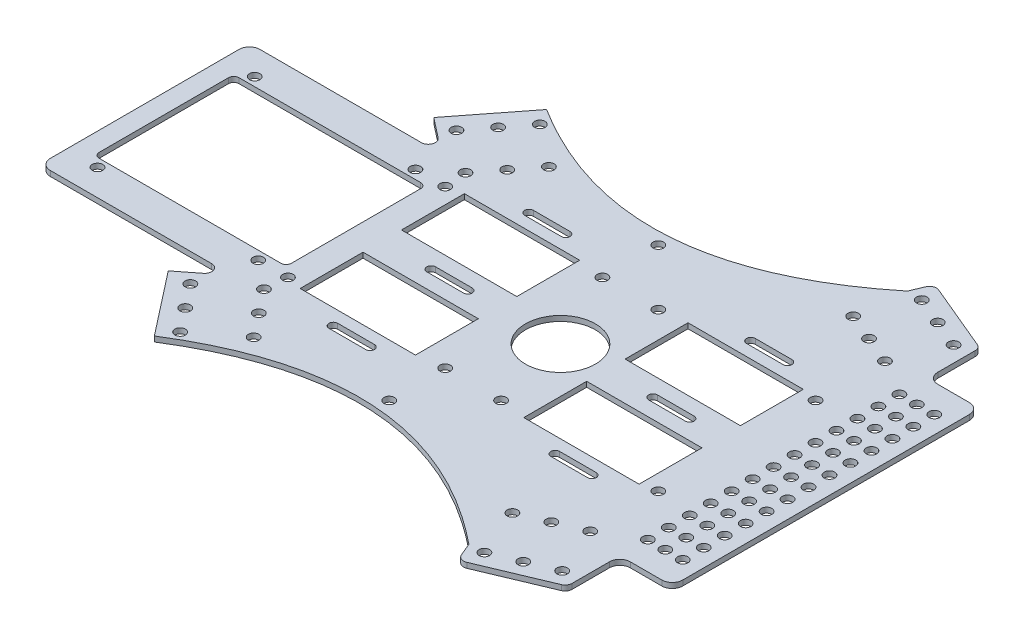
from build123d import *

# Parameters (mm, degrees)
EXTRUDE_2_DEPTH        = 1.5
CUT_EXTRUDE_1612_DEPTH = 207.41405532
SKETCH_6_R             = 10
SKETCH_6_W             = 33
SKETCH_6_H             = 18
CUT_EXTRUDE_2642_DEPTH = 207.41405532
SKETCH_7_R             = 1.5
CUT_EXTRUDE_3068_DEPTH = 207.41405532
SKETCH_8_R             = 1.5
CUT_EXTRUDE_3652_DEPTH = 207.41405532
SKETCH_9_R             = 1.5
CUT_EXTRUDE_4097_DEPTH = 207.41405532


with BuildPart() as part:
    # Sketch 1 → Extrude 2 (new body)
    with BuildSketch(Plane(origin=(0, 0, 0), x_dir=(1, 0, 0), z_dir=(0, 1, 0))):
        with BuildLine():
            Line((0, -27), (0, 27))
            ThreePointArc((0, 27), (0.878679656, 29.121320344), (3, 30))
            Line((3, 30), (49.188262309, 30))
            ThreePointArc((49.188262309, 30), (51.0794138, 31.349195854), (50.419031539, 33.576453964))
            Line((50.419031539, 33.576453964), (44.753049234, 38))
            Line((44.753049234, 38), (58.906895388, 56.129220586))
            add(Edge.make_bspline(
                [(58.906895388, 56.129220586), (108.824561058, 24.835581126), (155.548488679, 62.758137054)],
                knots=[0, 0, 0, 1, 1, 1], degree=2))
            Line((155.548488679, 62.758137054), (157.096883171, 66.446290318))
            ThreePointArc((157.096883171, 66.446290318), (158.184440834, 67.523492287), (159.715157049, 67.516169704))
            Line((159.715157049, 67.516169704), (178.774197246, 59.514627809))
            ThreePointArc((178.774197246, 59.514627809), (179.665592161, 58.777710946), (180, 57.670551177))
            Line((180, 57.670551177), (180, 47))
            ThreePointArc((180, 47), (180.878679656, 44.878679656), (183, 44))
            Line((183, 44), (192, 44))
            ThreePointArc((192, 44), (194.121320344, 43.121320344), (195, 41))
            Line((195, 41), (195, -41))
            ThreePointArc((195, -41), (194.121320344, -43.121320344), (192, -44))
            Line((192, -44), (183, -44))
            ThreePointArc((183, -44), (180.878679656, -44.878679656), (180, -47))
            Line((180, -47), (180, -57.670551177))
            ThreePointArc((180, -57.670551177), (179.665592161, -58.777710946), (178.774197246, -59.514627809))
            Line((178.774197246, -59.514627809), (159.715157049, -67.516169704))
            ThreePointArc((159.715157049, -67.516169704), (158.184440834, -67.523492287), (157.096883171, -66.446290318))
            Line((157.096883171, -66.446290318), (155.548488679, -62.758137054))
            add(Edge.make_bspline(
                [(58.906895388, -56.129220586), (108.824561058, -24.835581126), (155.548488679, -62.758137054)],
                knots=[0, 0, 0, 1, 1, 1], degree=2))
            Line((58.906895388, -56.129220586), (44.753049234, -38))
            Line((44.753049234, -38), (50.419031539, -33.576453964))
            ThreePointArc((50.419031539, -33.576453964), (51.0794138, -31.349195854), (49.188262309, -30))
            Line((49.188262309, -30), (3, -30))
            ThreePointArc((3, -30), (0.878679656, -29.121320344), (0, -27))
        make_face()
    extrude(amount=EXTRUDE_2_DEPTH)

    # Sketch 5 → Cut-Extrude 1612 (cut, through all)
    with BuildSketch(Plane(origin=(0, 1.5, 0), x_dir=(1, 0, 0), z_dir=(0, 1, 0))):
        with BuildLine():
            Line((7, 20), (59, 20))
            ThreePointArc((59, 20), (60.060660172, 19.560660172), (60.5, 18.5))
            Line((60.5, 18.5), (60.5, -18.5))
            ThreePointArc((60.5, -18.5), (60.060660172, -19.560660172), (59, -20))
            Line((59, -20), (7, -20))
            ThreePointArc((7, -20), (5.939339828, -19.560660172), (5.5, -18.5))
            Line((5.5, -18.5), (5.5, 18.5))
            ThreePointArc((5.5, 18.5), (5.939339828, 19.560660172), (7, 20))
        make_face()
    extrude(amount=-CUT_EXTRUDE_1612_DEPTH, mode=Mode.SUBTRACT)

    # Sketch 6 → Cut-Extrude 2642 (cut, through all)
    with BuildSketch(Plane(origin=(0, 1.5, 0), x_dir=(1, 0, 0), z_dir=(0, 1, 0))):
        with Locations(Location((119, 0, 0), (0, 0, 270))):
            Circle(SKETCH_6_R)
        with Locations((84.5, 14.5)):
            Rectangle(SKETCH_6_W, SKETCH_6_H)
        with Locations((148.5, 14.5)):
            Rectangle(SKETCH_6_W, SKETCH_6_H)
        with BuildLine():
            Line((145.5, 1.25), (156, 1.25))
            ThreePointArc((156, 1.25), (157.25, 0), (156, -1.25))
            Line((156, -1.25), (145.5, -1.25))
            ThreePointArc((145.5, -1.25), (144.25, 0), (145.5, 1.25))
        make_face()
        with BuildLine():
            Line((82, 1.25), (92.5, 1.25))
            ThreePointArc((92.5, 1.25), (93.75, 0), (92.5, -1.25))
            Line((92.5, -1.25), (82, -1.25))
            ThreePointArc((82, -1.25), (80.75, 0), (82, 1.25))
        make_face()
        with BuildLine():
            Line((145.5, 29.25), (156, 29.25))
            ThreePointArc((156, 29.25), (157.25, 28), (156, 26.75))
            Line((156, 26.75), (145.5, 26.75))
            ThreePointArc((145.5, 26.75), (144.25, 28), (145.5, 29.25))
        make_face()
        with BuildLine():
            Line((82, 29.25), (92.5, 29.25))
            ThreePointArc((92.5, 29.25), (93.75, 28), (92.5, 26.75))
            Line((92.5, 26.75), (82, 26.75))
            ThreePointArc((82, 26.75), (80.75, 28), (82, 29.25))
        make_face()
        with BuildLine():
            Line((145.5, -29.25), (156, -29.25))
            ThreePointArc((156, -29.25), (157.25, -28), (156, -26.75))
            Line((156, -26.75), (145.5, -26.75))
            ThreePointArc((145.5, -26.75), (144.25, -28), (145.5, -29.25))
        make_face()
        with BuildLine():
            Line((82, -29.25), (92.5, -29.25))
            ThreePointArc((92.5, -29.25), (93.75, -28), (92.5, -26.75))
            Line((92.5, -26.75), (82, -26.75))
            ThreePointArc((82, -26.75), (80.75, -28), (82, -29.25))
        make_face()
        with Locations((148.5, -14.5)):
            Rectangle(SKETCH_6_W, SKETCH_6_H)
        with Locations((84.5, -14.5)):
            Rectangle(SKETCH_6_W, SKETCH_6_H)
    extrude(amount=-CUT_EXTRUDE_2642_DEPTH, mode=Mode.SUBTRACT)

    # Sketch 7 → Cut-Extrude 3068 (cut, through all)
    with BuildSketch(Plane(origin=(0, 1.5, 0), x_dir=(1, 0, 0), z_dir=(0, 1, 0))):
        with Locations(Location((190, 36, 0), (0, 0, 270))):
            Circle(SKETCH_7_R)
        with Locations(Location((185, 36, 0), (0, 0, 270))):
            Circle(SKETCH_7_R)
        with Locations(Location((180, 36, 0), (0, 0, 270))):
            Circle(SKETCH_7_R)
        with Locations(Location((190, 30, 0), (0, 0, 270))):
            Circle(SKETCH_7_R)
        with Locations(Location((185, 30, 0), (0, 0, 270))):
            Circle(SKETCH_7_R)
        with Locations(Location((180, 30, 0), (0, 0, 270))):
            Circle(SKETCH_7_R)
        with Locations(Location((190, 24, 0), (0, 0, 270))):
            Circle(SKETCH_7_R)
        with Locations(Location((185, 24, 0), (0, 0, 270))):
            Circle(SKETCH_7_R)
        with Locations(Location((180, 24, 0), (0, 0, 270))):
            Circle(SKETCH_7_R)
        with Locations(Location((190, 18, 0), (0, 0, 270))):
            Circle(SKETCH_7_R)
        with Locations(Location((185, 18, 0), (0, 0, 270))):
            Circle(SKETCH_7_R)
        with Locations(Location((180, 18, 0), (0, 0, 270))):
            Circle(SKETCH_7_R)
        with Locations(Location((190, 12, 0), (0, 0, 270))):
            Circle(SKETCH_7_R)
        with Locations(Location((185, 12, 0), (0, 0, 270))):
            Circle(SKETCH_7_R)
        with Locations(Location((180, 12, 0), (0, 0, 270))):
            Circle(SKETCH_7_R)
        with Locations(Location((190, 6, 0), (0, 0, 270))):
            Circle(SKETCH_7_R)
        with Locations(Location((185, 6, 0), (0, 0, 270))):
            Circle(SKETCH_7_R)
        with Locations(Location((180, 6, 0), (0, 0, 270))):
            Circle(SKETCH_7_R)
        with Locations(Location((190, 0, 0), (0, 0, 270))):
            Circle(SKETCH_7_R)
        with Locations(Location((185, 0, 0), (0, 0, 270))):
            Circle(SKETCH_7_R)
        with Locations(Location((180, 0, 0), (0, 0, 270))):
            Circle(SKETCH_7_R)
        with Locations(Location((190, -6, 0), (0, 0, 270))):
            Circle(SKETCH_7_R)
        with Locations(Location((185, -6, 0), (0, 0, 270))):
            Circle(SKETCH_7_R)
        with Locations(Location((180, -6, 0), (0, 0, 270))):
            Circle(SKETCH_7_R)
        with Locations(Location((190, -12, 0), (0, 0, 270))):
            Circle(SKETCH_7_R)
        with Locations(Location((185, -12, 0), (0, 0, 270))):
            Circle(SKETCH_7_R)
        with Locations(Location((180, -12, 0), (0, 0, 270))):
            Circle(SKETCH_7_R)
        with Locations(Location((190, -18, 0), (0, 0, 270))):
            Circle(SKETCH_7_R)
        with Locations(Location((185, -18, 0), (0, 0, 270))):
            Circle(SKETCH_7_R)
        with Locations(Location((180, -18, 0), (0, 0, 270))):
            Circle(SKETCH_7_R)
        with Locations(Location((190, -24, 0), (0, 0, 270))):
            Circle(SKETCH_7_R)
        with Locations(Location((185, -24, 0), (0, 0, 270))):
            Circle(SKETCH_7_R)
        with Locations(Location((180, -24, 0), (0, 0, 270))):
            Circle(SKETCH_7_R)
        with Locations(Location((190, -30, 0), (0, 0, 270))):
            Circle(SKETCH_7_R)
        with Locations(Location((185, -30, 0), (0, 0, 270))):
            Circle(SKETCH_7_R)
        with Locations(Location((180, -30, 0), (0, 0, 270))):
            Circle(SKETCH_7_R)
        with Locations(Location((190, -36, 0), (0, 0, 270))):
            Circle(SKETCH_7_R)
        with Locations(Location((185, -36, 0), (0, 0, 270))):
            Circle(SKETCH_7_R)
        with Locations(Location((180, -36, 0), (0, 0, 270))):
            Circle(SKETCH_7_R)
    extrude(amount=-CUT_EXTRUDE_3068_DEPTH, mode=Mode.SUBTRACT)

    # Sketch 8 → Cut-Extrude 3652 (cut, through all)
    with BuildSketch(Plane(origin=(0, 1.5, 0), x_dir=(1, 0, 0), z_dir=(0, 1, 0))):
        with Locations(Location((51.155722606, 38.075984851, 0), (0, 0, 270))):
            Circle(SKETCH_8_R)
        with Locations(Location((56.386491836, 44.775914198, 0), (0, 0, 270))):
            Circle(SKETCH_8_R)
        with Locations(Location((61.617261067, 51.475843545, 0), (0, 0, 270))):
            Circle(SKETCH_8_R)
        with Locations(Location((62.979127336, 28.84521562, 0), (0, 0, 270))):
            Circle(SKETCH_8_R)
        with Locations(Location((68.209896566, 35.545144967, 0), (0, 0, 270))):
            Circle(SKETCH_8_R)
        with Locations(Location((73.440665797, 42.245074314, 0), (0, 0, 270))):
            Circle(SKETCH_8_R)
        with Locations(Location((159.817289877, 62.592800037, 0), (0, 0, 270))):
            Circle(SKETCH_8_R)
        with Locations(Location((167.654615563, 59.302461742, 0), (0, 0, 270))):
            Circle(SKETCH_8_R)
        with Locations(Location((175.491941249, 56.012123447, 0), (0, 0, 270))):
            Circle(SKETCH_8_R)
        with Locations(Location((154.010810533, 48.762225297, 0), (0, 0, 270))):
            Circle(SKETCH_8_R)
        with Locations(Location((161.848136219, 45.471887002, 0), (0, 0, 270))):
            Circle(SKETCH_8_R)
        with Locations(Location((169.685461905, 42.181548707, 0), (0, 0, 270))):
            Circle(SKETCH_8_R)
        with Locations(Location((159.817289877, -62.592800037, 0), (0, 0, 90))):
            Circle(SKETCH_8_R)
        with Locations(Location((167.654615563, -59.302461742, 0), (0, 0, 90))):
            Circle(SKETCH_8_R)
        with Locations(Location((175.491941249, -56.012123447, 0), (0, 0, 90))):
            Circle(SKETCH_8_R)
        with Locations(Location((169.685461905, -42.181548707, 0), (0, 0, 90))):
            Circle(SKETCH_8_R)
        with Locations(Location((161.848136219, -45.471887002, 0), (0, 0, 90))):
            Circle(SKETCH_8_R)
        with Locations(Location((154.010810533, -48.762225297, 0), (0, 0, 90))):
            Circle(SKETCH_8_R)
        with Locations(Location((51.155722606, -38.075984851, 0), (0, 0, 90))):
            Circle(SKETCH_8_R)
        with Locations(Location((62.979127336, -28.84521562, 0), (0, 0, 90))):
            Circle(SKETCH_8_R)
        with Locations(Location((68.209896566, -35.545144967, 0), (0, 0, 90))):
            Circle(SKETCH_8_R)
        with Locations(Location((56.386491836, -44.775914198, 0), (0, 0, 90))):
            Circle(SKETCH_8_R)
        with Locations(Location((61.617261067, -51.475843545, 0), (0, 0, 90))):
            Circle(SKETCH_8_R)
        with Locations(Location((73.440665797, -42.245074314, 0), (0, 0, 90))):
            Circle(SKETCH_8_R)
    extrude(amount=-CUT_EXTRUDE_3652_DEPTH, mode=Mode.SUBTRACT)

    # Sketch 9 → Cut-Extrude 4097 (cut, through all)
    with BuildSketch(Plane(origin=(0, 1.5, 0), x_dir=(1, 0, 0), z_dir=(0, 1, 0))):
        with Locations(Location((9, 22.5, 0), (0, 0, 270))):
            Circle(SKETCH_9_R)
        with Locations(Location((63.5, 22.5, 0), (0, 0, 270))):
            Circle(SKETCH_9_R)
        with Locations(Location((55, 22.5, 0), (0, 0, 270))):
            Circle(SKETCH_9_R)
        with Locations(Location((108.5, 22.5, 0), (0, 0, 270))):
            Circle(SKETCH_9_R)
        with Locations(Location((124.5, 22.5, 0), (0, 0, 270))):
            Circle(SKETCH_9_R)
        with Locations(Location((169.5, 22.5, 0), (0, 0, 270))):
            Circle(SKETCH_9_R)
        with Locations(Location((108.5, 38.5, 0), (0, 0, 270))):
            Circle(SKETCH_9_R)
        with Locations(Location((169.5, -22.5, 0), (0, 0, 90))):
            Circle(SKETCH_9_R)
        with Locations(Location((124.5, -22.5, 0), (0, 0, 90))):
            Circle(SKETCH_9_R)
        with Locations(Location((108.5, -38.5, 0), (0, 0, 90))):
            Circle(SKETCH_9_R)
        with Locations(Location((108.5, -22.5, 0), (0, 0, 90))):
            Circle(SKETCH_9_R)
        with Locations(Location((63.5, -22.5, 0), (0, 0, 90))):
            Circle(SKETCH_9_R)
        with Locations(Location((55, -22.5, 0), (0, 0, 90))):
            Circle(SKETCH_9_R)
        with Locations(Location((9, -22.5, 0), (0, 0, 90))):
            Circle(SKETCH_9_R)
    extrude(amount=-CUT_EXTRUDE_4097_DEPTH, mode=Mode.SUBTRACT)


solid = part.part
